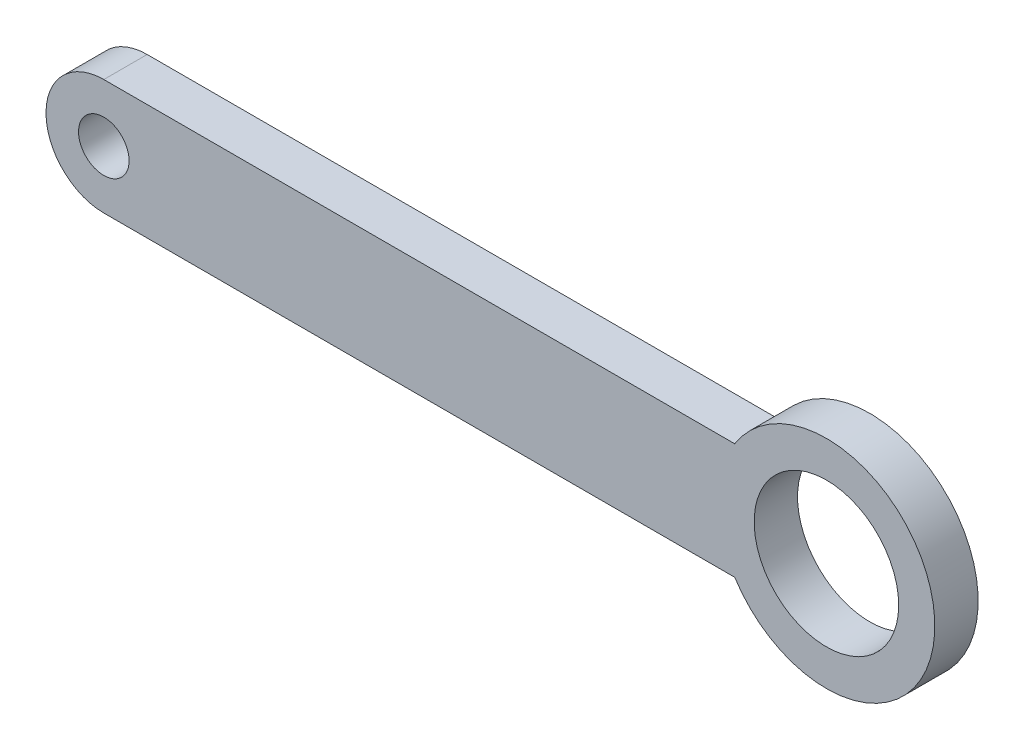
from build123d import *

# Parameters (mm, degrees)
ESQUISSE1_R        = 5
ESQUISSE1_R_2      = 1.75
BOSS_EXTRU_1_DEPTH = 3


with BuildPart() as part:
    # Esquisse1 → Boss.-Extru.1 (new body)
    with BuildSketch(Plane.XY):
        with BuildLine():
            Line((-50, 4), (-6.34428877, 4))
            ThreePointArc((-6.34428877, 4), (7.5, 0), (-6.34428877, -4))
            Line((-6.34428877, -4), (-50, -4))
            ThreePointArc((-50, -4), (-54, 0), (-50, 4))
        make_face()
        Circle(ESQUISSE1_R, mode=Mode.SUBTRACT)
        with Locations((-50, 0)):
            Circle(ESQUISSE1_R_2, mode=Mode.SUBTRACT)
    extrude(amount=BOSS_EXTRU_1_DEPTH)


solid = part.part
